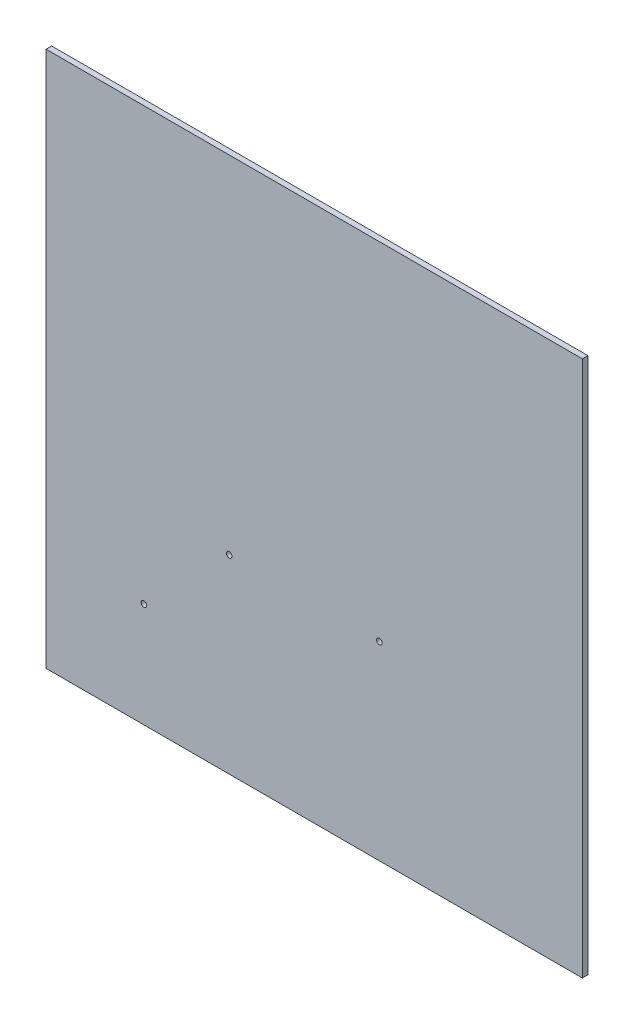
ISO-10303-21;
HEADER;
FILE_DESCRIPTION(('STEP AP214'),'2;1');
FILE_NAME('part.step','',(''),(''),'','','');
FILE_SCHEMA(('AUTOMOTIVE_DESIGN { 1 0 10303 214 1 1 1 1 }'));
ENDSEC;
DATA;
#1=APPLICATION_CONTEXT('core data for automotive mechanical design processes');
#2=APPLICATION_PROTOCOL_DEFINITION('international standard','automotive_design',2000,#1);
#3=PRODUCT_CONTEXT('',#1,'mechanical');
#4=PRODUCT('Part','Part','',(#3));
#5=PRODUCT_RELATED_PRODUCT_CATEGORY('part','',(#4));
#6=PRODUCT_DEFINITION_FORMATION('','',#4);
#7=PRODUCT_DEFINITION_CONTEXT('part definition',#1,'design');
#8=PRODUCT_DEFINITION('design','',#6,#7);
#9=PRODUCT_DEFINITION_SHAPE('','',#8);
#10=(LENGTH_UNIT() NAMED_UNIT(*) SI_UNIT(.MILLI.,.METRE.));
#11=(NAMED_UNIT(*) PLANE_ANGLE_UNIT() SI_UNIT($,.RADIAN.));
#12=(NAMED_UNIT(*) SI_UNIT($,.STERADIAN.) SOLID_ANGLE_UNIT());
#13=UNCERTAINTY_MEASURE_WITH_UNIT(LENGTH_MEASURE(1.E-05),#10,'distance_accuracy_value','');
#14=(GEOMETRIC_REPRESENTATION_CONTEXT(3) GLOBAL_UNCERTAINTY_ASSIGNED_CONTEXT((#13)) GLOBAL_UNIT_ASSIGNED_CONTEXT((#10,
#11,#12)) REPRESENTATION_CONTEXT('',''));
#15=CARTESIAN_POINT('',(0.,0.,0.));
#16=DIRECTION('',(0.,0.,1.));
#17=DIRECTION('',(1.,0.,0.));
#18=AXIS2_PLACEMENT_3D('',#15,#16,#17);
#19=CARTESIAN_POINT('',(0.,0.,3.175));
#20=DIRECTION('',(0.,0.,-1.));
#21=DIRECTION('',(-1.,0.,0.));
#22=AXIS2_PLACEMENT_3D('',#19,#20,#21);
#23=PLANE('',#22);
#24=DIRECTION('',(0.,-1.,0.));
#25=VECTOR('',#24,1.);
#26=CARTESIAN_POINT('',(0.,0.,3.175));
#27=LINE('',#26,#25);
#28=CARTESIAN_POINT('',(0.,304.8,3.175));
#29=VERTEX_POINT('',#28);
#30=CARTESIAN_POINT('',(0.,0.,3.175));
#31=VERTEX_POINT('',#30);
#32=EDGE_CURVE('E84',#29,#31,#27,.T.);
#33=ORIENTED_EDGE('',*,*,#32,.T.);
#34=DIRECTION('',(1.,0.,0.));
#35=VECTOR('',#34,1.);
#36=CARTESIAN_POINT('',(0.,0.,3.175));
#37=LINE('',#36,#35);
#38=CARTESIAN_POINT('',(304.8,0.,3.175));
#39=VERTEX_POINT('',#38);
#40=EDGE_CURVE('E79',#31,#39,#37,.T.);
#41=ORIENTED_EDGE('',*,*,#40,.T.);
#42=DIRECTION('',(0.,1.,0.));
#43=VECTOR('',#42,1.);
#44=CARTESIAN_POINT('',(304.8,0.,3.175));
#45=LINE('',#44,#43);
#46=CARTESIAN_POINT('',(304.8,304.8,3.175));
#47=VERTEX_POINT('',#46);
#48=EDGE_CURVE('E82',#39,#47,#45,.T.);
#49=ORIENTED_EDGE('',*,*,#48,.T.);
#50=DIRECTION('',(-1.,0.,0.));
#51=VECTOR('',#50,1.);
#52=CARTESIAN_POINT('',(0.,304.8,3.175));
#53=LINE('',#52,#51);
#54=EDGE_CURVE('E49',#47,#29,#53,.T.);
#55=ORIENTED_EDGE('',*,*,#54,.T.);
#56=EDGE_LOOP('',(#33,#41,#49,#55));
#57=FACE_BOUND('',#56,.T.);
#58=CARTESIAN_POINT('',(104.077318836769,107.973535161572,3.175));
#59=DIRECTION('',(0.,0.,1.));
#60=DIRECTION('',(1.,0.,0.));
#61=AXIS2_PLACEMENT_3D('',#58,#59,#60);
#62=CIRCLE('',#61,1.58749999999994);
#63=CARTESIAN_POINT('',(105.664818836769,107.973535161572,3.175));
#64=VERTEX_POINT('',#63);
#65=EDGE_CURVE('E99',#64,#64,#62,.T.);
#66=ORIENTED_EDGE('',*,*,#65,.F.);
#67=EDGE_LOOP('',(#66));
#68=FACE_BOUND('',#67,.T.);
#69=CARTESIAN_POINT('',(189.421318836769,107.973535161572,3.175));
#70=DIRECTION('',(0.,0.,1.));
#71=DIRECTION('',(1.,0.,0.));
#72=AXIS2_PLACEMENT_3D('',#69,#70,#71);
#73=CIRCLE('',#72,1.58749999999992);
#74=CARTESIAN_POINT('',(191.008818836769,107.973535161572,3.175));
#75=VERTEX_POINT('',#74);
#76=EDGE_CURVE('E114',#75,#75,#73,.T.);
#77=ORIENTED_EDGE('',*,*,#76,.F.);
#78=EDGE_LOOP('',(#77));
#79=FACE_BOUND('',#78,.T.);
#80=CARTESIAN_POINT('',(55.5839357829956,59.4801521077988,3.175));
#81=DIRECTION('',(0.,0.,1.));
#82=DIRECTION('',(1.,0.,0.));
#83=AXIS2_PLACEMENT_3D('',#80,#81,#82);
#84=CIRCLE('',#83,1.58749999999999);
#85=CARTESIAN_POINT('',(57.1714357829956,59.4801521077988,3.175));
#86=VERTEX_POINT('',#85);
#87=EDGE_CURVE('E120',#86,#86,#84,.T.);
#88=ORIENTED_EDGE('',*,*,#87,.F.);
#89=EDGE_LOOP('',(#88));
#90=FACE_BOUND('',#89,.T.);
#91=ADVANCED_FACE('F32',(#57,#68,#79,#90),#23,.F.);
#92=CARTESIAN_POINT('',(0.,0.,0.));
#93=DIRECTION('',(0.,0.,-1.));
#94=DIRECTION('',(-1.,0.,0.));
#95=AXIS2_PLACEMENT_3D('',#92,#93,#94);
#96=PLANE('',#95);
#97=CARTESIAN_POINT('',(189.421318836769,107.973535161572,0.));
#98=DIRECTION('',(0.,0.,1.));
#99=DIRECTION('',(1.,0.,0.));
#100=AXIS2_PLACEMENT_3D('',#97,#98,#99);
#101=CIRCLE('',#100,1.58749999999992);
#102=CARTESIAN_POINT('',(191.008818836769,107.973535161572,0.));
#103=VERTEX_POINT('',#102);
#104=EDGE_CURVE('E117',#103,#103,#101,.T.);
#105=ORIENTED_EDGE('',*,*,#104,.T.);
#106=EDGE_LOOP('',(#105));
#107=FACE_BOUND('',#106,.T.);
#108=DIRECTION('',(0.,-1.,0.));
#109=VECTOR('',#108,1.);
#110=CARTESIAN_POINT('',(0.,0.,0.));
#111=LINE('',#110,#109);
#112=CARTESIAN_POINT('',(0.,304.8,0.));
#113=VERTEX_POINT('',#112);
#114=CARTESIAN_POINT('',(0.,0.,0.));
#115=VERTEX_POINT('',#114);
#116=EDGE_CURVE('E96',#113,#115,#111,.T.);
#117=ORIENTED_EDGE('',*,*,#116,.F.);
#118=DIRECTION('',(-1.,0.,0.));
#119=VECTOR('',#118,1.);
#120=CARTESIAN_POINT('',(0.,304.8,0.));
#121=LINE('',#120,#119);
#122=CARTESIAN_POINT('',(304.8,304.8,0.));
#123=VERTEX_POINT('',#122);
#124=EDGE_CURVE('E72',#123,#113,#121,.T.);
#125=ORIENTED_EDGE('',*,*,#124,.F.);
#126=DIRECTION('',(0.,1.,0.));
#127=VECTOR('',#126,1.);
#128=CARTESIAN_POINT('',(304.8,0.,0.));
#129=LINE('',#128,#127);
#130=CARTESIAN_POINT('',(304.8,0.,0.));
#131=VERTEX_POINT('',#130);
#132=EDGE_CURVE('E66',#131,#123,#129,.T.);
#133=ORIENTED_EDGE('',*,*,#132,.F.);
#134=DIRECTION('',(1.,0.,0.));
#135=VECTOR('',#134,1.);
#136=CARTESIAN_POINT('',(0.,0.,0.));
#137=LINE('',#136,#135);
#138=EDGE_CURVE('E88',#115,#131,#137,.T.);
#139=ORIENTED_EDGE('',*,*,#138,.F.);
#140=EDGE_LOOP('',(#117,#125,#133,#139));
#141=FACE_BOUND('',#140,.T.);
#142=CARTESIAN_POINT('',(104.077318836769,107.973535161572,0.));
#143=DIRECTION('',(0.,0.,1.));
#144=DIRECTION('',(1.,0.,0.));
#145=AXIS2_PLACEMENT_3D('',#142,#143,#144);
#146=CIRCLE('',#145,1.58749999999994);
#147=CARTESIAN_POINT('',(105.664818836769,107.973535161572,0.));
#148=VERTEX_POINT('',#147);
#149=EDGE_CURVE('E111',#148,#148,#146,.T.);
#150=ORIENTED_EDGE('',*,*,#149,.T.);
#151=EDGE_LOOP('',(#150));
#152=FACE_BOUND('',#151,.T.);
#153=CARTESIAN_POINT('',(55.5839357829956,59.4801521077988,0.));
#154=DIRECTION('',(0.,0.,1.));
#155=DIRECTION('',(1.,0.,0.));
#156=AXIS2_PLACEMENT_3D('',#153,#154,#155);
#157=CIRCLE('',#156,1.58749999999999);
#158=CARTESIAN_POINT('',(57.1714357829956,59.4801521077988,0.));
#159=VERTEX_POINT('',#158);
#160=EDGE_CURVE('E123',#159,#159,#157,.T.);
#161=ORIENTED_EDGE('',*,*,#160,.T.);
#162=EDGE_LOOP('',(#161));
#163=FACE_BOUND('',#162,.T.);
#164=ADVANCED_FACE('F107',(#107,#141,#152,#163),#96,.T.);
#165=CARTESIAN_POINT('',(0.,0.,3.175));
#166=DIRECTION('',(1.,0.,0.));
#167=DIRECTION('',(0.,0.,-1.));
#168=AXIS2_PLACEMENT_3D('',#165,#166,#167);
#169=PLANE('',#168);
#170=ORIENTED_EDGE('',*,*,#116,.T.);
#171=DIRECTION('',(0.,0.,-1.));
#172=VECTOR('',#171,1.);
#173=CARTESIAN_POINT('',(0.,0.,3.175));
#174=LINE('',#173,#172);
#175=EDGE_CURVE('E11',#31,#115,#174,.T.);
#176=ORIENTED_EDGE('',*,*,#175,.F.);
#177=ORIENTED_EDGE('',*,*,#32,.F.);
#178=DIRECTION('',(0.,0.,-1.));
#179=VECTOR('',#178,1.);
#180=CARTESIAN_POINT('',(0.,304.8,3.175));
#181=LINE('',#180,#179);
#182=EDGE_CURVE('E92',#29,#113,#181,.T.);
#183=ORIENTED_EDGE('',*,*,#182,.T.);
#184=EDGE_LOOP('',(#170,#176,#177,#183));
#185=FACE_BOUND('',#184,.T.);
#186=ADVANCED_FACE('F34',(#185),#169,.F.);
#187=CARTESIAN_POINT('',(0.,0.,3.175));
#188=DIRECTION('',(0.,1.,0.));
#189=DIRECTION('',(0.,0.,1.));
#190=AXIS2_PLACEMENT_3D('',#187,#188,#189);
#191=PLANE('',#190);
#192=ORIENTED_EDGE('',*,*,#138,.T.);
#193=DIRECTION('',(0.,0.,-1.));
#194=VECTOR('',#193,1.);
#195=CARTESIAN_POINT('',(304.8,0.,3.175));
#196=LINE('',#195,#194);
#197=EDGE_CURVE('E41',#39,#131,#196,.T.);
#198=ORIENTED_EDGE('',*,*,#197,.F.);
#199=ORIENTED_EDGE('',*,*,#40,.F.);
#200=ORIENTED_EDGE('',*,*,#175,.T.);
#201=EDGE_LOOP('',(#192,#198,#199,#200));
#202=FACE_BOUND('',#201,.T.);
#203=ADVANCED_FACE('F87',(#202),#191,.F.);
#204=CARTESIAN_POINT('',(304.8,0.,3.175));
#205=DIRECTION('',(-1.,0.,0.));
#206=DIRECTION('',(0.,0.,1.));
#207=AXIS2_PLACEMENT_3D('',#204,#205,#206);
#208=PLANE('',#207);
#209=ORIENTED_EDGE('',*,*,#132,.T.);
#210=DIRECTION('',(0.,0.,-1.));
#211=VECTOR('',#210,1.);
#212=CARTESIAN_POINT('',(304.8,304.8,3.175));
#213=LINE('',#212,#211);
#214=EDGE_CURVE('E89',#47,#123,#213,.T.);
#215=ORIENTED_EDGE('',*,*,#214,.F.);
#216=ORIENTED_EDGE('',*,*,#48,.F.);
#217=ORIENTED_EDGE('',*,*,#197,.T.);
#218=EDGE_LOOP('',(#209,#215,#216,#217));
#219=FACE_BOUND('',#218,.T.);
#220=ADVANCED_FACE('F90',(#219),#208,.F.);
#221=CARTESIAN_POINT('',(0.,304.8,3.175));
#222=DIRECTION('',(0.,-1.,0.));
#223=DIRECTION('',(0.,0.,-1.));
#224=AXIS2_PLACEMENT_3D('',#221,#222,#223);
#225=PLANE('',#224);
#226=ORIENTED_EDGE('',*,*,#124,.T.);
#227=ORIENTED_EDGE('',*,*,#182,.F.);
#228=ORIENTED_EDGE('',*,*,#54,.F.);
#229=ORIENTED_EDGE('',*,*,#214,.T.);
#230=EDGE_LOOP('',(#226,#227,#228,#229));
#231=FACE_BOUND('',#230,.T.);
#232=ADVANCED_FACE('F104',(#231),#225,.F.);
#233=CARTESIAN_POINT('',(104.077318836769,107.973535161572,3.175));
#234=DIRECTION('',(0.,0.,-1.));
#235=DIRECTION('',(-1.,0.,0.));
#236=AXIS2_PLACEMENT_3D('',#233,#234,#235);
#237=CYLINDRICAL_SURFACE('',#236,1.58749999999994);
#238=ORIENTED_EDGE('',*,*,#65,.T.);
#239=EDGE_LOOP('',(#238));
#240=FACE_BOUND('',#239,.T.);
#241=ORIENTED_EDGE('',*,*,#149,.F.);
#242=EDGE_LOOP('',(#241));
#243=FACE_BOUND('',#242,.T.);
#244=ADVANCED_FACE('F140',(#240,#243),#237,.F.);
#245=CARTESIAN_POINT('',(189.421318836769,107.973535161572,3.175));
#246=DIRECTION('',(0.,0.,-1.));
#247=DIRECTION('',(-1.,0.,0.));
#248=AXIS2_PLACEMENT_3D('',#245,#246,#247);
#249=CYLINDRICAL_SURFACE('',#248,1.58749999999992);
#250=ORIENTED_EDGE('',*,*,#76,.T.);
#251=EDGE_LOOP('',(#250));
#252=FACE_BOUND('',#251,.T.);
#253=ORIENTED_EDGE('',*,*,#104,.F.);
#254=EDGE_LOOP('',(#253));
#255=FACE_BOUND('',#254,.T.);
#256=ADVANCED_FACE('F186',(#252,#255),#249,.F.);
#257=CARTESIAN_POINT('',(55.5839357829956,59.4801521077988,3.175));
#258=DIRECTION('',(0.,0.,-1.));
#259=DIRECTION('',(-1.,0.,0.));
#260=AXIS2_PLACEMENT_3D('',#257,#258,#259);
#261=CYLINDRICAL_SURFACE('',#260,1.58749999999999);
#262=ORIENTED_EDGE('',*,*,#87,.T.);
#263=EDGE_LOOP('',(#262));
#264=FACE_BOUND('',#263,.T.);
#265=ORIENTED_EDGE('',*,*,#160,.F.);
#266=EDGE_LOOP('',(#265));
#267=FACE_BOUND('',#266,.T.);
#268=ADVANCED_FACE('F129',(#264,#267),#261,.F.);
#269=CLOSED_SHELL('',(#91,#164,#186,#203,#220,#232,#244,#256,#268));
#270=MANIFOLD_SOLID_BREP('B2',#269);
#271=ADVANCED_BREP_SHAPE_REPRESENTATION('',(#18,#270),#14);
#272=SHAPE_DEFINITION_REPRESENTATION(#9,#271);
ENDSEC;
END-ISO-10303-21;
